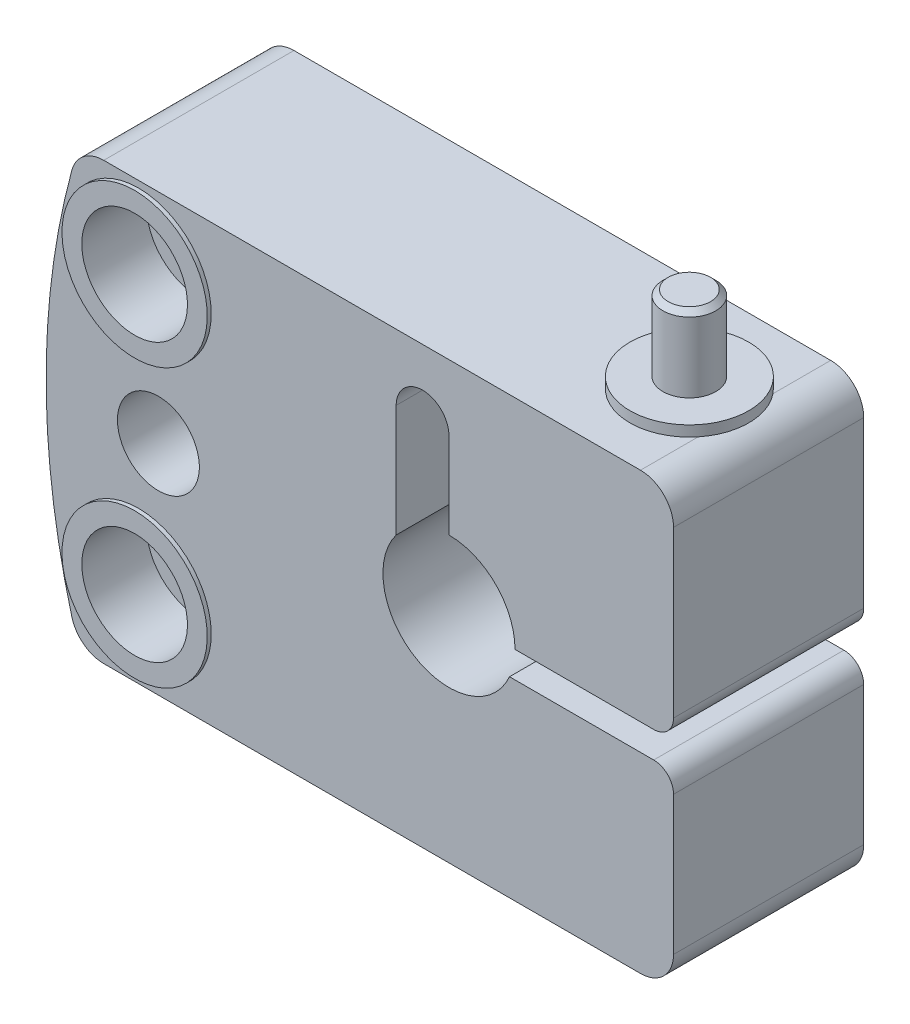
ISO-10303-21;
HEADER;
FILE_DESCRIPTION(('STEP AP214'),'2;1');
FILE_NAME('part.step','',(''),(''),'','','');
FILE_SCHEMA(('AUTOMOTIVE_DESIGN { 1 0 10303 214 1 1 1 1 }'));
ENDSEC;
DATA;
#1=APPLICATION_CONTEXT('core data for automotive mechanical design processes');
#2=APPLICATION_PROTOCOL_DEFINITION('international standard','automotive_design',2000,#1);
#3=PRODUCT_CONTEXT('',#1,'mechanical');
#4=PRODUCT('Part','Part','',(#3));
#5=PRODUCT_RELATED_PRODUCT_CATEGORY('part','',(#4));
#6=PRODUCT_DEFINITION_FORMATION('','',#4);
#7=PRODUCT_DEFINITION_CONTEXT('part definition',#1,'design');
#8=PRODUCT_DEFINITION('design','',#6,#7);
#9=PRODUCT_DEFINITION_SHAPE('','',#8);
#10=(LENGTH_UNIT() NAMED_UNIT(*) SI_UNIT(.MILLI.,.METRE.));
#11=(NAMED_UNIT(*) PLANE_ANGLE_UNIT() SI_UNIT($,.RADIAN.));
#12=(NAMED_UNIT(*) SI_UNIT($,.STERADIAN.) SOLID_ANGLE_UNIT());
#13=UNCERTAINTY_MEASURE_WITH_UNIT(LENGTH_MEASURE(1.E-05),#10,'distance_accuracy_value','');
#14=(GEOMETRIC_REPRESENTATION_CONTEXT(3) GLOBAL_UNCERTAINTY_ASSIGNED_CONTEXT((#13)) GLOBAL_UNIT_ASSIGNED_CONTEXT((#10,
#11,#12)) REPRESENTATION_CONTEXT('',''));
#15=CARTESIAN_POINT('',(0.,0.,0.));
#16=DIRECTION('',(0.,0.,1.));
#17=DIRECTION('',(1.,0.,0.));
#18=AXIS2_PLACEMENT_3D('',#15,#16,#17);
#19=CARTESIAN_POINT('',(14.5,16.5,15.));
#20=DIRECTION('',(0.,-1.,0.));
#21=DIRECTION('',(0.,0.,1.));
#22=AXIS2_PLACEMENT_3D('',#19,#20,#21);
#23=PLANE('',#22);
#24=CARTESIAN_POINT('',(11.,16.5,7.5));
#25=DIRECTION('',(0.,1.,0.));
#26=DIRECTION('',(0.,0.,-1.));
#27=AXIS2_PLACEMENT_3D('',#24,#25,#26);
#28=CIRCLE('',#27,4.5);
#29=CARTESIAN_POINT('',(14.5,16.5,4.67157287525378));
#30=VERTEX_POINT('',#29);
#31=CARTESIAN_POINT('',(14.5,16.5,10.3284271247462));
#32=VERTEX_POINT('',#31);
#33=EDGE_CURVE('E34',#30,#32,#28,.T.);
#34=ORIENTED_EDGE('',*,*,#33,.F.);
#35=DIRECTION('',(0.,0.,-1.));
#36=VECTOR('',#35,1.);
#37=CARTESIAN_POINT('',(14.5,16.5,15.));
#38=LINE('',#37,#36);
#39=CARTESIAN_POINT('',(14.5,16.5,0.3));
#40=VERTEX_POINT('',#39);
#41=EDGE_CURVE('E156',#30,#40,#38,.T.);
#42=ORIENTED_EDGE('',*,*,#41,.T.);
#43=DIRECTION('',(1.,0.,0.));
#44=VECTOR('',#43,1.);
#45=CARTESIAN_POINT('',(-26.1357434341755,16.5,0.3));
#46=LINE('',#45,#44);
#47=CARTESIAN_POINT('',(-26.1357434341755,16.5,0.3));
#48=VERTEX_POINT('',#47);
#49=EDGE_CURVE('E308',#48,#40,#46,.T.);
#50=ORIENTED_EDGE('',*,*,#49,.F.);
#51=DIRECTION('',(0.,0.,-1.));
#52=VECTOR('',#51,1.);
#53=CARTESIAN_POINT('',(-26.1357434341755,16.5,15.));
#54=LINE('',#53,#52);
#55=CARTESIAN_POINT('',(-26.1357434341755,16.5,14.7));
#56=VERTEX_POINT('',#55);
#57=EDGE_CURVE('E347',#56,#48,#54,.T.);
#58=ORIENTED_EDGE('',*,*,#57,.F.);
#59=DIRECTION('',(-1.,0.,0.));
#60=VECTOR('',#59,1.);
#61=CARTESIAN_POINT('',(14.5,16.5,14.7));
#62=LINE('',#61,#60);
#63=CARTESIAN_POINT('',(14.5,16.5,14.7));
#64=VERTEX_POINT('',#63);
#65=EDGE_CURVE('E152',#64,#56,#62,.T.);
#66=ORIENTED_EDGE('',*,*,#65,.F.);
#67=EDGE_CURVE('E149',#64,#32,#38,.T.);
#68=ORIENTED_EDGE('',*,*,#67,.T.);
#69=EDGE_LOOP('',(#34,#42,#50,#58,#66,#68));
#70=FACE_BOUND('',#69,.T.);
#71=ADVANCED_FACE('F18',(#70),#23,.F.);
#72=CARTESIAN_POINT('',(-23.5,10.5,15.));
#73=DIRECTION('',(0.,0.,-1.));
#74=DIRECTION('',(0.,-1.,0.));
#75=AXIS2_PLACEMENT_3D('',#72,#73,#74);
#76=CYLINDRICAL_SURFACE('',#75,2.25);
#77=CARTESIAN_POINT('',(-23.5,10.5,4.9));
#78=DIRECTION('',(0.,0.,-1.));
#79=DIRECTION('',(0.,-1.,0.));
#80=AXIS2_PLACEMENT_3D('',#77,#78,#79);
#81=CIRCLE('',#80,2.25);
#82=CARTESIAN_POINT('',(-23.5,8.25,4.9));
#83=VERTEX_POINT('',#82);
#84=EDGE_CURVE('E207',#83,#83,#81,.T.);
#85=ORIENTED_EDGE('',*,*,#84,.T.);
#86=EDGE_LOOP('',(#85));
#87=FACE_BOUND('',#86,.T.);
#88=CARTESIAN_POINT('',(-23.5,10.5,10.1));
#89=DIRECTION('',(0.,0.,1.));
#90=DIRECTION('',(0.,1.,0.));
#91=AXIS2_PLACEMENT_3D('',#88,#89,#90);
#92=CIRCLE('',#91,2.25);
#93=CARTESIAN_POINT('',(-23.5,12.75,10.1));
#94=VERTEX_POINT('',#93);
#95=EDGE_CURVE('E187',#94,#94,#92,.T.);
#96=ORIENTED_EDGE('',*,*,#95,.T.);
#97=EDGE_LOOP('',(#96));
#98=FACE_BOUND('',#97,.T.);
#99=ADVANCED_FACE('F389',(#87,#98),#76,.F.);
#100=CARTESIAN_POINT('',(-23.5,-10.5,15.));
#101=DIRECTION('',(0.,0.,-1.));
#102=DIRECTION('',(0.,-1.,0.));
#103=AXIS2_PLACEMENT_3D('',#100,#101,#102);
#104=CYLINDRICAL_SURFACE('',#103,2.25);
#105=CARTESIAN_POINT('',(-23.5,-10.5,4.9));
#106=DIRECTION('',(0.,0.,-1.));
#107=DIRECTION('',(0.,-1.,0.));
#108=AXIS2_PLACEMENT_3D('',#105,#106,#107);
#109=CIRCLE('',#108,2.25);
#110=CARTESIAN_POINT('',(-23.5,-12.75,4.9));
#111=VERTEX_POINT('',#110);
#112=EDGE_CURVE('E200',#111,#111,#109,.T.);
#113=ORIENTED_EDGE('',*,*,#112,.T.);
#114=EDGE_LOOP('',(#113));
#115=FACE_BOUND('',#114,.T.);
#116=CARTESIAN_POINT('',(-23.5,-10.5,10.1));
#117=DIRECTION('',(0.,0.,1.));
#118=DIRECTION('',(0.,1.,0.));
#119=AXIS2_PLACEMENT_3D('',#116,#117,#118);
#120=CIRCLE('',#119,2.25);
#121=CARTESIAN_POINT('',(-23.5,-8.25,10.1));
#122=VERTEX_POINT('',#121);
#123=EDGE_CURVE('E193',#122,#122,#120,.T.);
#124=ORIENTED_EDGE('',*,*,#123,.T.);
#125=EDGE_LOOP('',(#124));
#126=FACE_BOUND('',#125,.T.);
#127=ADVANCED_FACE('F395',(#115,#126),#104,.F.);
#128=CARTESIAN_POINT('',(0.,0.,15.));
#129=DIRECTION('',(0.,0.,1.));
#130=DIRECTION('',(0.,1.,0.));
#131=AXIS2_PLACEMENT_3D('',#128,#129,#130);
#132=PLANE('',#131);
#133=CARTESIAN_POINT('',(-23.5,10.5,15.));
#134=DIRECTION('',(0.,0.,1.));
#135=DIRECTION('',(0.,1.,0.));
#136=AXIS2_PLACEMENT_3D('',#133,#134,#135);
#137=CIRCLE('',#136,4.);
#138=CARTESIAN_POINT('',(-23.5,14.5,15.));
#139=VERTEX_POINT('',#138);
#140=EDGE_CURVE('E183',#139,#139,#137,.T.);
#141=ORIENTED_EDGE('',*,*,#140,.F.);
#142=EDGE_LOOP('',(#141));
#143=FACE_BOUND('',#142,.T.);
#144=CARTESIAN_POINT('',(-23.5,10.5,15.));
#145=DIRECTION('',(0.,0.,1.));
#146=DIRECTION('',(0.,1.,0.));
#147=AXIS2_PLACEMENT_3D('',#144,#145,#146);
#148=CIRCLE('',#147,5.5);
#149=CARTESIAN_POINT('',(-23.5,16.,15.));
#150=VERTEX_POINT('',#149);
#151=EDGE_CURVE('E211',#150,#150,#148,.T.);
#152=ORIENTED_EDGE('',*,*,#151,.T.);
#153=EDGE_LOOP('',(#152));
#154=FACE_BOUND('',#153,.T.);
#155=ADVANCED_FACE('F828',(#143,#154),#132,.T.);
#156=CARTESIAN_POINT('',(-23.5,-10.5,15.));
#157=DIRECTION('',(0.,0.,1.));
#158=DIRECTION('',(0.,1.,0.));
#159=AXIS2_PLACEMENT_3D('',#156,#157,#158);
#160=CIRCLE('',#159,4.);
#161=CARTESIAN_POINT('',(-23.5,-6.5,15.));
#162=VERTEX_POINT('',#161);
#163=EDGE_CURVE('E194',#162,#162,#160,.T.);
#164=ORIENTED_EDGE('',*,*,#163,.F.);
#165=EDGE_LOOP('',(#164));
#166=FACE_BOUND('',#165,.T.);
#167=CARTESIAN_POINT('',(-23.5,-10.5,15.));
#168=DIRECTION('',(0.,0.,1.));
#169=DIRECTION('',(0.,1.,0.));
#170=AXIS2_PLACEMENT_3D('',#167,#168,#169);
#171=CIRCLE('',#170,5.5);
#172=CARTESIAN_POINT('',(-23.5,-5.,15.));
#173=VERTEX_POINT('',#172);
#174=EDGE_CURVE('E214',#173,#173,#171,.T.);
#175=ORIENTED_EDGE('',*,*,#174,.T.);
#176=EDGE_LOOP('',(#175));
#177=FACE_BOUND('',#176,.T.);
#178=ADVANCED_FACE('F836',(#166,#177),#132,.T.);
#179=CARTESIAN_POINT('',(0.,0.,0.));
#180=DIRECTION('',(0.,0.,1.));
#181=DIRECTION('',(0.,1.,0.));
#182=AXIS2_PLACEMENT_3D('',#179,#180,#181);
#183=PLANE('',#182);
#184=CARTESIAN_POINT('',(-23.5,10.5,0.));
#185=DIRECTION('',(0.,0.,-1.));
#186=DIRECTION('',(0.,-1.,0.));
#187=AXIS2_PLACEMENT_3D('',#184,#185,#186);
#188=CIRCLE('',#187,4.);
#189=CARTESIAN_POINT('',(-23.5,6.5,0.));
#190=VERTEX_POINT('',#189);
#191=EDGE_CURVE('E208',#190,#190,#188,.T.);
#192=ORIENTED_EDGE('',*,*,#191,.F.);
#193=EDGE_LOOP('',(#192));
#194=FACE_BOUND('',#193,.T.);
#195=CARTESIAN_POINT('',(-23.5,10.5,0.));
#196=DIRECTION('',(0.,0.,-1.));
#197=DIRECTION('',(0.,-1.,0.));
#198=AXIS2_PLACEMENT_3D('',#195,#196,#197);
#199=CIRCLE('',#198,5.5);
#200=CARTESIAN_POINT('',(-23.5,5.,0.));
#201=VERTEX_POINT('',#200);
#202=EDGE_CURVE('E261',#201,#201,#199,.T.);
#203=ORIENTED_EDGE('',*,*,#202,.T.);
#204=EDGE_LOOP('',(#203));
#205=FACE_BOUND('',#204,.T.);
#206=ADVANCED_FACE('F423',(#194,#205),#183,.F.);
#207=CARTESIAN_POINT('',(-23.5,-10.5,0.));
#208=DIRECTION('',(0.,0.,-1.));
#209=DIRECTION('',(0.,-1.,0.));
#210=AXIS2_PLACEMENT_3D('',#207,#208,#209);
#211=CIRCLE('',#210,4.);
#212=CARTESIAN_POINT('',(-23.5,-14.5,0.));
#213=VERTEX_POINT('',#212);
#214=EDGE_CURVE('E201',#213,#213,#211,.T.);
#215=ORIENTED_EDGE('',*,*,#214,.F.);
#216=EDGE_LOOP('',(#215));
#217=FACE_BOUND('',#216,.T.);
#218=CARTESIAN_POINT('',(-23.5,-10.5,0.));
#219=DIRECTION('',(0.,0.,-1.));
#220=DIRECTION('',(0.,-1.,0.));
#221=AXIS2_PLACEMENT_3D('',#218,#219,#220);
#222=CIRCLE('',#221,5.5);
#223=CARTESIAN_POINT('',(-23.5,-16.,0.));
#224=VERTEX_POINT('',#223);
#225=EDGE_CURVE('E222',#224,#224,#222,.T.);
#226=ORIENTED_EDGE('',*,*,#225,.T.);
#227=EDGE_LOOP('',(#226));
#228=FACE_BOUND('',#227,.T.);
#229=ADVANCED_FACE('F417',(#217,#228),#183,.F.);
#230=CARTESIAN_POINT('',(0.,0.,15.));
#231=DIRECTION('',(0.,0.,-1.));
#232=DIRECTION('',(0.,-1.,0.));
#233=AXIS2_PLACEMENT_3D('',#230,#231,#232);
#234=CYLINDRICAL_SURFACE('',#233,5.);
#235=DIRECTION('',(0.,0.,-1.));
#236=VECTOR('',#235,1.);
#237=CARTESIAN_POINT('',(5.,0.,15.));
#238=LINE('',#237,#236);
#239=CARTESIAN_POINT('',(5.,0.,14.7));
#240=VERTEX_POINT('',#239);
#241=CARTESIAN_POINT('',(5.,0.,0.3));
#242=VERTEX_POINT('',#241);
#243=EDGE_CURVE('E354',#240,#242,#238,.T.);
#244=ORIENTED_EDGE('',*,*,#243,.F.);
#245=CARTESIAN_POINT('',(0.,0.,14.7));
#246=DIRECTION('',(0.,0.,-1.));
#247=DIRECTION('',(0.,-1.,0.));
#248=AXIS2_PLACEMENT_3D('',#245,#246,#247);
#249=CIRCLE('',#248,5.);
#250=CARTESIAN_POINT('',(0.,5.,14.7));
#251=VERTEX_POINT('',#250);
#252=EDGE_CURVE('E227',#251,#240,#249,.T.);
#253=ORIENTED_EDGE('',*,*,#252,.F.);
#254=DIRECTION('',(0.,0.,-1.));
#255=VECTOR('',#254,1.);
#256=CARTESIAN_POINT('',(0.,5.,15.));
#257=LINE('',#256,#255);
#258=CARTESIAN_POINT('',(0.,5.,0.3));
#259=VERTEX_POINT('',#258);
#260=EDGE_CURVE('E323',#251,#259,#257,.T.);
#261=ORIENTED_EDGE('',*,*,#260,.T.);
#262=CARTESIAN_POINT('',(0.,0.,0.3));
#263=DIRECTION('',(0.,0.,1.));
#264=DIRECTION('',(0.,-1.,0.));
#265=AXIS2_PLACEMENT_3D('',#262,#263,#264);
#266=CIRCLE('',#265,5.);
#267=EDGE_CURVE('E267',#242,#259,#266,.T.);
#268=ORIENTED_EDGE('',*,*,#267,.F.);
#269=EDGE_LOOP('',(#244,#253,#261,#268));
#270=FACE_BOUND('',#269,.T.);
#271=ADVANCED_FACE('F414',(#270),#234,.F.);
#272=CARTESIAN_POINT('',(5.,0.,15.));
#273=DIRECTION('',(0.,1.,0.));
#274=DIRECTION('',(-1.,0.,0.));
#275=AXIS2_PLACEMENT_3D('',#272,#273,#274);
#276=PLANE('',#275);
#277=CARTESIAN_POINT('',(11.,0.,7.5));
#278=DIRECTION('',(0.,1.,0.));
#279=DIRECTION('',(-1.,0.,0.));
#280=AXIS2_PLACEMENT_3D('',#277,#278,#279);
#281=CIRCLE('',#280,2.);
#282=CARTESIAN_POINT('',(9.,0.,7.5));
#283=VERTEX_POINT('',#282);
#284=EDGE_CURVE('E180',#283,#283,#281,.T.);
#285=ORIENTED_EDGE('',*,*,#284,.T.);
#286=EDGE_LOOP('',(#285));
#287=FACE_BOUND('',#286,.T.);
#288=DIRECTION('',(0.,0.,-1.));
#289=VECTOR('',#288,1.);
#290=CARTESIAN_POINT('',(15.5,0.,15.));
#291=LINE('',#290,#289);
#292=CARTESIAN_POINT('',(15.5,0.,14.7));
#293=VERTEX_POINT('',#292);
#294=CARTESIAN_POINT('',(15.5,0.,0.3));
#295=VERTEX_POINT('',#294);
#296=EDGE_CURVE('E352',#293,#295,#291,.T.);
#297=ORIENTED_EDGE('',*,*,#296,.F.);
#298=DIRECTION('',(1.,0.,0.));
#299=VECTOR('',#298,1.);
#300=CARTESIAN_POINT('',(5.,0.,14.7));
#301=LINE('',#300,#299);
#302=EDGE_CURVE('E215',#240,#293,#301,.T.);
#303=ORIENTED_EDGE('',*,*,#302,.F.);
#304=ORIENTED_EDGE('',*,*,#243,.T.);
#305=DIRECTION('',(-1.,0.,0.));
#306=VECTOR('',#305,1.);
#307=CARTESIAN_POINT('',(15.5,0.,0.3));
#308=LINE('',#307,#306);
#309=EDGE_CURVE('E320',#295,#242,#308,.T.);
#310=ORIENTED_EDGE('',*,*,#309,.F.);
#311=EDGE_LOOP('',(#297,#303,#304,#310));
#312=FACE_BOUND('',#311,.T.);
#313=ADVANCED_FACE('F411',(#287,#312),#276,.F.);
#314=CARTESIAN_POINT('',(15.5,1.5,15.));
#315=DIRECTION('',(0.,0.,-1.));
#316=DIRECTION('',(0.,-1.,0.));
#317=AXIS2_PLACEMENT_3D('',#314,#315,#316);
#318=CYLINDRICAL_SURFACE('',#317,1.5);
#319=DIRECTION('',(0.,0.,-1.));
#320=VECTOR('',#319,1.);
#321=CARTESIAN_POINT('',(17.,1.5,15.));
#322=LINE('',#321,#320);
#323=CARTESIAN_POINT('',(17.,1.5,14.7));
#324=VERTEX_POINT('',#323);
#325=CARTESIAN_POINT('',(17.,1.5,0.3));
#326=VERTEX_POINT('',#325);
#327=EDGE_CURVE('E350',#324,#326,#322,.T.);
#328=ORIENTED_EDGE('',*,*,#327,.F.);
#329=CARTESIAN_POINT('',(15.5,1.5,14.7));
#330=DIRECTION('',(0.,0.,-1.));
#331=DIRECTION('',(0.,-1.,0.));
#332=AXIS2_PLACEMENT_3D('',#329,#330,#331);
#333=CIRCLE('',#332,1.5);
#334=EDGE_CURVE('E226',#293,#324,#333,.F.);
#335=ORIENTED_EDGE('',*,*,#334,.F.);
#336=ORIENTED_EDGE('',*,*,#296,.T.);
#337=CARTESIAN_POINT('',(15.5,1.5,0.3));
#338=DIRECTION('',(0.,0.,-1.));
#339=DIRECTION('',(0.,-1.,0.));
#340=AXIS2_PLACEMENT_3D('',#337,#338,#339);
#341=CIRCLE('',#340,1.5);
#342=EDGE_CURVE('E317',#326,#295,#341,.T.);
#343=ORIENTED_EDGE('',*,*,#342,.F.);
#344=EDGE_LOOP('',(#328,#335,#336,#343));
#345=FACE_BOUND('',#344,.T.);
#346=ADVANCED_FACE('F407',(#345),#318,.T.);
#347=CARTESIAN_POINT('',(17.,1.5,15.));
#348=DIRECTION('',(-1.,0.,0.));
#349=DIRECTION('',(0.,0.,1.));
#350=AXIS2_PLACEMENT_3D('',#347,#348,#349);
#351=PLANE('',#350);
#352=DIRECTION('',(0.,0.,-1.));
#353=VECTOR('',#352,1.);
#354=CARTESIAN_POINT('',(17.,14.,15.));
#355=LINE('',#354,#353);
#356=CARTESIAN_POINT('',(17.,14.,14.7));
#357=VERTEX_POINT('',#356);
#358=CARTESIAN_POINT('',(17.,14.,0.3));
#359=VERTEX_POINT('',#358);
#360=EDGE_CURVE('E155',#357,#359,#355,.T.);
#361=ORIENTED_EDGE('',*,*,#360,.F.);
#362=DIRECTION('',(0.,1.,0.));
#363=VECTOR('',#362,1.);
#364=CARTESIAN_POINT('',(17.,1.5,14.7));
#365=LINE('',#364,#363);
#366=EDGE_CURVE('E255',#324,#357,#365,.T.);
#367=ORIENTED_EDGE('',*,*,#366,.F.);
#368=ORIENTED_EDGE('',*,*,#327,.T.);
#369=DIRECTION('',(0.,-1.,0.));
#370=VECTOR('',#369,1.);
#371=CARTESIAN_POINT('',(17.,14.,0.3));
#372=LINE('',#371,#370);
#373=EDGE_CURVE('E314',#359,#326,#372,.T.);
#374=ORIENTED_EDGE('',*,*,#373,.F.);
#375=EDGE_LOOP('',(#361,#367,#368,#374));
#376=FACE_BOUND('',#375,.T.);
#377=ADVANCED_FACE('F404',(#376),#351,.F.);
#378=CARTESIAN_POINT('',(14.5,14.,15.));
#379=DIRECTION('',(0.,0.,-1.));
#380=DIRECTION('',(0.,-1.,0.));
#381=AXIS2_PLACEMENT_3D('',#378,#379,#380);
#382=CYLINDRICAL_SURFACE('',#381,2.5);
#383=ORIENTED_EDGE('',*,*,#67,.F.);
#384=CARTESIAN_POINT('',(14.5,14.,14.7));
#385=DIRECTION('',(0.,0.,-1.));
#386=DIRECTION('',(0.,-1.,0.));
#387=AXIS2_PLACEMENT_3D('',#384,#385,#386);
#388=CIRCLE('',#387,2.5);
#389=EDGE_CURVE('E253',#357,#64,#388,.F.);
#390=ORIENTED_EDGE('',*,*,#389,.F.);
#391=ORIENTED_EDGE('',*,*,#360,.T.);
#392=CARTESIAN_POINT('',(14.5,14.,0.3));
#393=DIRECTION('',(0.,0.,-1.));
#394=DIRECTION('',(0.,-1.,0.));
#395=AXIS2_PLACEMENT_3D('',#392,#393,#394);
#396=CIRCLE('',#395,2.5);
#397=EDGE_CURVE('E311',#40,#359,#396,.T.);
#398=ORIENTED_EDGE('',*,*,#397,.F.);
#399=ORIENTED_EDGE('',*,*,#41,.F.);
#400=DIRECTION('',(0.,0.,-1.));
#401=VECTOR('',#400,1.);
#402=CARTESIAN_POINT('',(14.5,16.5,15.));
#403=LINE('',#402,#401);
#404=EDGE_CURVE('E159',#32,#30,#403,.T.);
#405=ORIENTED_EDGE('',*,*,#404,.F.);
#406=EDGE_LOOP('',(#383,#390,#391,#398,#399,#405));
#407=FACE_BOUND('',#406,.T.);
#408=ADVANCED_FACE('F160',(#407),#382,.T.);
#409=CARTESIAN_POINT('',(-26.1357434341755,14.,15.));
#410=DIRECTION('',(0.,0.,-1.));
#411=DIRECTION('',(0.,-1.,0.));
#412=AXIS2_PLACEMENT_3D('',#409,#410,#411);
#413=CYLINDRICAL_SURFACE('',#412,2.5);
#414=DIRECTION('',(0.,0.,-1.));
#415=VECTOR('',#414,1.);
#416=CARTESIAN_POINT('',(-28.54862864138,14.6542056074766,15.));
#417=LINE('',#416,#415);
#418=CARTESIAN_POINT('',(-28.54862864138,14.6542056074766,14.7));
#419=VERTEX_POINT('',#418);
#420=CARTESIAN_POINT('',(-28.54862864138,14.6542056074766,0.3));
#421=VERTEX_POINT('',#420);
#422=EDGE_CURVE('E345',#419,#421,#417,.T.);
#423=ORIENTED_EDGE('',*,*,#422,.F.);
#424=CARTESIAN_POINT('',(-26.1357434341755,14.,14.7));
#425=DIRECTION('',(0.,0.,-1.));
#426=DIRECTION('',(0.,-1.,0.));
#427=AXIS2_PLACEMENT_3D('',#424,#425,#426);
#428=CIRCLE('',#427,2.5);
#429=EDGE_CURVE('E250',#56,#419,#428,.F.);
#430=ORIENTED_EDGE('',*,*,#429,.F.);
#431=ORIENTED_EDGE('',*,*,#57,.T.);
#432=CARTESIAN_POINT('',(-26.1357434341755,14.,0.3));
#433=DIRECTION('',(0.,0.,-1.));
#434=DIRECTION('',(0.,-1.,0.));
#435=AXIS2_PLACEMENT_3D('',#432,#433,#434);
#436=CIRCLE('',#435,2.5);
#437=EDGE_CURVE('E305',#421,#48,#436,.T.);
#438=ORIENTED_EDGE('',*,*,#437,.F.);
#439=EDGE_LOOP('',(#423,#430,#431,#438));
#440=FACE_BOUND('',#439,.T.);
#441=ADVANCED_FACE('F400',(#440),#413,.T.);
#442=CARTESIAN_POINT('',(25.5,0.,15.));
#443=DIRECTION('',(0.,0.,-1.));
#444=DIRECTION('',(0.,-1.,0.));
#445=AXIS2_PLACEMENT_3D('',#442,#443,#444);
#446=CYLINDRICAL_SURFACE('',#445,56.);
#447=DIRECTION('',(0.,0.,-1.));
#448=VECTOR('',#447,1.);
#449=CARTESIAN_POINT('',(-28.54862864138,-14.6542056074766,15.));
#450=LINE('',#449,#448);
#451=CARTESIAN_POINT('',(-28.54862864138,-14.6542056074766,14.7));
#452=VERTEX_POINT('',#451);
#453=CARTESIAN_POINT('',(-28.54862864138,-14.6542056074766,0.3));
#454=VERTEX_POINT('',#453);
#455=EDGE_CURVE('E343',#452,#454,#450,.T.);
#456=ORIENTED_EDGE('',*,*,#455,.F.);
#457=CARTESIAN_POINT('',(25.5,0.,14.7));
#458=DIRECTION('',(0.,0.,-1.));
#459=DIRECTION('',(0.,-1.,0.));
#460=AXIS2_PLACEMENT_3D('',#457,#458,#459);
#461=CIRCLE('',#460,56.);
#462=EDGE_CURVE('E248',#419,#452,#461,.F.);
#463=ORIENTED_EDGE('',*,*,#462,.F.);
#464=ORIENTED_EDGE('',*,*,#422,.T.);
#465=CARTESIAN_POINT('',(25.5,0.,0.3));
#466=DIRECTION('',(0.,0.,-1.));
#467=DIRECTION('',(0.,-1.,0.));
#468=AXIS2_PLACEMENT_3D('',#465,#466,#467);
#469=CIRCLE('',#468,56.);
#470=EDGE_CURVE('E302',#454,#421,#469,.T.);
#471=ORIENTED_EDGE('',*,*,#470,.F.);
#472=EDGE_LOOP('',(#456,#463,#464,#471));
#473=FACE_BOUND('',#472,.T.);
#474=ADVANCED_FACE('F454',(#473),#446,.T.);
#475=CARTESIAN_POINT('',(-26.1357434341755,-14.,15.));
#476=DIRECTION('',(0.,0.,-1.));
#477=DIRECTION('',(0.,-1.,0.));
#478=AXIS2_PLACEMENT_3D('',#475,#476,#477);
#479=CYLINDRICAL_SURFACE('',#478,2.5);
#480=DIRECTION('',(0.,0.,-1.));
#481=VECTOR('',#480,1.);
#482=CARTESIAN_POINT('',(-26.1357434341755,-16.5,15.));
#483=LINE('',#482,#481);
#484=CARTESIAN_POINT('',(-26.1357434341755,-16.5,14.7));
#485=VERTEX_POINT('',#484);
#486=CARTESIAN_POINT('',(-26.1357434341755,-16.5,0.3));
#487=VERTEX_POINT('',#486);
#488=EDGE_CURVE('E341',#485,#487,#483,.T.);
#489=ORIENTED_EDGE('',*,*,#488,.F.);
#490=CARTESIAN_POINT('',(-26.1357434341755,-14.,14.7));
#491=DIRECTION('',(0.,0.,-1.));
#492=DIRECTION('',(0.,-1.,0.));
#493=AXIS2_PLACEMENT_3D('',#490,#491,#492);
#494=CIRCLE('',#493,2.5);
#495=EDGE_CURVE('E246',#452,#485,#494,.F.);
#496=ORIENTED_EDGE('',*,*,#495,.F.);
#497=ORIENTED_EDGE('',*,*,#455,.T.);
#498=CARTESIAN_POINT('',(-26.1357434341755,-14.,0.3));
#499=DIRECTION('',(0.,0.,-1.));
#500=DIRECTION('',(0.,-1.,0.));
#501=AXIS2_PLACEMENT_3D('',#498,#499,#500);
#502=CIRCLE('',#501,2.5);
#503=EDGE_CURVE('E299',#487,#454,#502,.T.);
#504=ORIENTED_EDGE('',*,*,#503,.F.);
#505=EDGE_LOOP('',(#489,#496,#497,#504));
#506=FACE_BOUND('',#505,.T.);
#507=ADVANCED_FACE('F459',(#506),#479,.T.);
#508=CARTESIAN_POINT('',(-26.1357434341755,-16.5,15.));
#509=DIRECTION('',(0.,1.,0.));
#510=DIRECTION('',(0.,0.,-1.));
#511=AXIS2_PLACEMENT_3D('',#508,#509,#510);
#512=PLANE('',#511);
#513=DIRECTION('',(0.,0.,-1.));
#514=VECTOR('',#513,1.);
#515=CARTESIAN_POINT('',(14.5,-16.5,15.));
#516=LINE('',#515,#514);
#517=CARTESIAN_POINT('',(14.5,-16.5,14.7));
#518=VERTEX_POINT('',#517);
#519=CARTESIAN_POINT('',(14.5,-16.5,0.3));
#520=VERTEX_POINT('',#519);
#521=EDGE_CURVE('E339',#518,#520,#516,.T.);
#522=ORIENTED_EDGE('',*,*,#521,.F.);
#523=DIRECTION('',(1.,0.,0.));
#524=VECTOR('',#523,1.);
#525=CARTESIAN_POINT('',(-26.1357434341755,-16.5,14.7));
#526=LINE('',#525,#524);
#527=EDGE_CURVE('E244',#485,#518,#526,.T.);
#528=ORIENTED_EDGE('',*,*,#527,.F.);
#529=ORIENTED_EDGE('',*,*,#488,.T.);
#530=DIRECTION('',(-1.,0.,0.));
#531=VECTOR('',#530,1.);
#532=CARTESIAN_POINT('',(14.5,-16.5,0.3));
#533=LINE('',#532,#531);
#534=EDGE_CURVE('E296',#520,#487,#533,.T.);
#535=ORIENTED_EDGE('',*,*,#534,.F.);
#536=EDGE_LOOP('',(#522,#528,#529,#535));
#537=FACE_BOUND('',#536,.T.);
#538=ADVANCED_FACE('F464',(#537),#512,.F.);
#539=CARTESIAN_POINT('',(14.5,-14.,15.));
#540=DIRECTION('',(0.,0.,-1.));
#541=DIRECTION('',(0.,-1.,0.));
#542=AXIS2_PLACEMENT_3D('',#539,#540,#541);
#543=CYLINDRICAL_SURFACE('',#542,2.5);
#544=DIRECTION('',(0.,0.,-1.));
#545=VECTOR('',#544,1.);
#546=CARTESIAN_POINT('',(17.,-14.,15.));
#547=LINE('',#546,#545);
#548=CARTESIAN_POINT('',(17.,-14.,14.7));
#549=VERTEX_POINT('',#548);
#550=CARTESIAN_POINT('',(17.,-14.,0.3));
#551=VERTEX_POINT('',#550);
#552=EDGE_CURVE('E337',#549,#551,#547,.T.);
#553=ORIENTED_EDGE('',*,*,#552,.F.);
#554=CARTESIAN_POINT('',(14.5,-14.,14.7));
#555=DIRECTION('',(0.,0.,-1.));
#556=DIRECTION('',(0.,-1.,0.));
#557=AXIS2_PLACEMENT_3D('',#554,#555,#556);
#558=CIRCLE('',#557,2.5);
#559=EDGE_CURVE('E242',#518,#549,#558,.F.);
#560=ORIENTED_EDGE('',*,*,#559,.F.);
#561=ORIENTED_EDGE('',*,*,#521,.T.);
#562=CARTESIAN_POINT('',(14.5,-14.,0.3));
#563=DIRECTION('',(0.,0.,-1.));
#564=DIRECTION('',(0.,-1.,0.));
#565=AXIS2_PLACEMENT_3D('',#562,#563,#564);
#566=CIRCLE('',#565,2.5);
#567=EDGE_CURVE('E293',#551,#520,#566,.T.);
#568=ORIENTED_EDGE('',*,*,#567,.F.);
#569=EDGE_LOOP('',(#553,#560,#561,#568));
#570=FACE_BOUND('',#569,.T.);
#571=ADVANCED_FACE('F470',(#570),#543,.T.);
#572=CARTESIAN_POINT('',(17.,-14.,15.));
#573=DIRECTION('',(-1.,0.,0.));
#574=DIRECTION('',(0.,0.,1.));
#575=AXIS2_PLACEMENT_3D('',#572,#573,#574);
#576=PLANE('',#575);
#577=DIRECTION('',(0.,0.,-1.));
#578=VECTOR('',#577,1.);
#579=CARTESIAN_POINT('',(17.,-3.5,15.));
#580=LINE('',#579,#578);
#581=CARTESIAN_POINT('',(17.,-3.5,14.7));
#582=VERTEX_POINT('',#581);
#583=CARTESIAN_POINT('',(17.,-3.5,0.3));
#584=VERTEX_POINT('',#583);
#585=EDGE_CURVE('E335',#582,#584,#580,.T.);
#586=ORIENTED_EDGE('',*,*,#585,.F.);
#587=DIRECTION('',(0.,1.,0.));
#588=VECTOR('',#587,1.);
#589=CARTESIAN_POINT('',(17.,-14.,14.7));
#590=LINE('',#589,#588);
#591=EDGE_CURVE('E240',#549,#582,#590,.T.);
#592=ORIENTED_EDGE('',*,*,#591,.F.);
#593=ORIENTED_EDGE('',*,*,#552,.T.);
#594=DIRECTION('',(0.,-1.,0.));
#595=VECTOR('',#594,1.);
#596=CARTESIAN_POINT('',(17.,-3.5,0.3));
#597=LINE('',#596,#595);
#598=EDGE_CURVE('E290',#584,#551,#597,.T.);
#599=ORIENTED_EDGE('',*,*,#598,.F.);
#600=EDGE_LOOP('',(#586,#592,#593,#599));
#601=FACE_BOUND('',#600,.T.);
#602=ADVANCED_FACE('F474',(#601),#576,.F.);
#603=CARTESIAN_POINT('',(15.5,-3.5,15.));
#604=DIRECTION('',(0.,0.,-1.));
#605=DIRECTION('',(0.,-1.,0.));
#606=AXIS2_PLACEMENT_3D('',#603,#604,#605);
#607=CYLINDRICAL_SURFACE('',#606,1.5);
#608=DIRECTION('',(0.,0.,-1.));
#609=VECTOR('',#608,1.);
#610=CARTESIAN_POINT('',(15.5,-2.,15.));
#611=LINE('',#610,#609);
#612=CARTESIAN_POINT('',(15.5,-2.,14.7));
#613=VERTEX_POINT('',#612);
#614=CARTESIAN_POINT('',(15.5,-2.,0.3));
#615=VERTEX_POINT('',#614);
#616=EDGE_CURVE('E333',#613,#615,#611,.T.);
#617=ORIENTED_EDGE('',*,*,#616,.F.);
#618=CARTESIAN_POINT('',(15.5,-3.5,14.7));
#619=DIRECTION('',(0.,0.,-1.));
#620=DIRECTION('',(0.,-1.,0.));
#621=AXIS2_PLACEMENT_3D('',#618,#619,#620);
#622=CIRCLE('',#621,1.5);
#623=EDGE_CURVE('E238',#582,#613,#622,.F.);
#624=ORIENTED_EDGE('',*,*,#623,.F.);
#625=ORIENTED_EDGE('',*,*,#585,.T.);
#626=CARTESIAN_POINT('',(15.5,-3.5,0.3));
#627=DIRECTION('',(0.,0.,-1.));
#628=DIRECTION('',(0.,-1.,0.));
#629=AXIS2_PLACEMENT_3D('',#626,#627,#628);
#630=CIRCLE('',#629,1.5);
#631=EDGE_CURVE('E287',#615,#584,#630,.T.);
#632=ORIENTED_EDGE('',*,*,#631,.F.);
#633=EDGE_LOOP('',(#617,#624,#625,#632));
#634=FACE_BOUND('',#633,.T.);
#635=ADVANCED_FACE('F479',(#634),#607,.T.);
#636=CARTESIAN_POINT('',(15.5,-2.,15.));
#637=DIRECTION('',(0.,-1.,0.));
#638=DIRECTION('',(1.,0.,0.));
#639=AXIS2_PLACEMENT_3D('',#636,#637,#638);
#640=PLANE('',#639);
#641=CARTESIAN_POINT('',(11.,-2.00000000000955,7.5));
#642=DIRECTION('',(0.,-1.,0.));
#643=DIRECTION('',(1.,0.,0.));
#644=AXIS2_PLACEMENT_3D('',#641,#642,#643);
#645=CIRCLE('',#644,2.);
#646=CARTESIAN_POINT('',(13.,-2.00000000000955,7.5));
#647=VERTEX_POINT('',#646);
#648=EDGE_CURVE('E165',#647,#647,#645,.F.);
#649=ORIENTED_EDGE('',*,*,#648,.F.);
#650=EDGE_LOOP('',(#649));
#651=FACE_BOUND('',#650,.T.);
#652=DIRECTION('',(0.,0.,-1.));
#653=VECTOR('',#652,1.);
#654=CARTESIAN_POINT('',(4.58257569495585,-2.,15.));
#655=LINE('',#654,#653);
#656=CARTESIAN_POINT('',(4.58257569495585,-2.,14.7));
#657=VERTEX_POINT('',#656);
#658=CARTESIAN_POINT('',(4.58257569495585,-2.,0.3));
#659=VERTEX_POINT('',#658);
#660=EDGE_CURVE('E331',#657,#659,#655,.T.);
#661=ORIENTED_EDGE('',*,*,#660,.F.);
#662=DIRECTION('',(-1.,0.,0.));
#663=VECTOR('',#662,1.);
#664=CARTESIAN_POINT('',(15.5,-2.,14.7));
#665=LINE('',#664,#663);
#666=EDGE_CURVE('E236',#613,#657,#665,.T.);
#667=ORIENTED_EDGE('',*,*,#666,.F.);
#668=ORIENTED_EDGE('',*,*,#616,.T.);
#669=DIRECTION('',(1.,0.,0.));
#670=VECTOR('',#669,1.);
#671=CARTESIAN_POINT('',(4.58257569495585,-2.,0.3));
#672=LINE('',#671,#670);
#673=EDGE_CURVE('E284',#659,#615,#672,.T.);
#674=ORIENTED_EDGE('',*,*,#673,.F.);
#675=EDGE_LOOP('',(#661,#667,#668,#674));
#676=FACE_BOUND('',#675,.T.);
#677=ADVANCED_FACE('F485',(#651,#676),#640,.F.);
#678=CARTESIAN_POINT('',(0.,0.,15.));
#679=DIRECTION('',(0.,0.,-1.));
#680=DIRECTION('',(0.,-1.,0.));
#681=AXIS2_PLACEMENT_3D('',#678,#679,#680);
#682=CYLINDRICAL_SURFACE('',#681,5.);
#683=DIRECTION('',(0.,0.,-1.));
#684=VECTOR('',#683,1.);
#685=CARTESIAN_POINT('',(-4.,3.,15.));
#686=LINE('',#685,#684);
#687=CARTESIAN_POINT('',(-4.,3.,14.7));
#688=VERTEX_POINT('',#687);
#689=CARTESIAN_POINT('',(-4.,3.,0.3));
#690=VERTEX_POINT('',#689);
#691=EDGE_CURVE('E329',#688,#690,#686,.T.);
#692=ORIENTED_EDGE('',*,*,#691,.F.);
#693=CARTESIAN_POINT('',(0.,0.,14.7));
#694=DIRECTION('',(0.,0.,-1.));
#695=DIRECTION('',(0.,-1.,0.));
#696=AXIS2_PLACEMENT_3D('',#693,#694,#695);
#697=CIRCLE('',#696,5.);
#698=EDGE_CURVE('E234',#657,#688,#697,.T.);
#699=ORIENTED_EDGE('',*,*,#698,.F.);
#700=ORIENTED_EDGE('',*,*,#660,.T.);
#701=CARTESIAN_POINT('',(0.,0.,0.3));
#702=DIRECTION('',(0.,0.,1.));
#703=DIRECTION('',(0.,-1.,0.));
#704=AXIS2_PLACEMENT_3D('',#701,#702,#703);
#705=CIRCLE('',#704,5.);
#706=EDGE_CURVE('E281',#690,#659,#705,.T.);
#707=ORIENTED_EDGE('',*,*,#706,.F.);
#708=EDGE_LOOP('',(#692,#699,#700,#707));
#709=FACE_BOUND('',#708,.T.);
#710=ADVANCED_FACE('F489',(#709),#682,.F.);
#711=CARTESIAN_POINT('',(-4.,11.5,15.));
#712=DIRECTION('',(-1.,0.,0.));
#713=DIRECTION('',(0.,-1.,0.));
#714=AXIS2_PLACEMENT_3D('',#711,#712,#713);
#715=PLANE('',#714);
#716=DIRECTION('',(0.,0.,-1.));
#717=VECTOR('',#716,1.);
#718=CARTESIAN_POINT('',(-4.,11.5,15.));
#719=LINE('',#718,#717);
#720=CARTESIAN_POINT('',(-4.,11.5,14.7));
#721=VERTEX_POINT('',#720);
#722=CARTESIAN_POINT('',(-4.,11.5,0.3));
#723=VERTEX_POINT('',#722);
#724=EDGE_CURVE('E327',#721,#723,#719,.T.);
#725=ORIENTED_EDGE('',*,*,#724,.F.);
#726=DIRECTION('',(0.,1.,0.));
#727=VECTOR('',#726,1.);
#728=CARTESIAN_POINT('',(-4.,3.,14.7));
#729=LINE('',#728,#727);
#730=EDGE_CURVE('E232',#688,#721,#729,.T.);
#731=ORIENTED_EDGE('',*,*,#730,.F.);
#732=ORIENTED_EDGE('',*,*,#691,.T.);
#733=DIRECTION('',(0.,-1.,0.));
#734=VECTOR('',#733,1.);
#735=CARTESIAN_POINT('',(-4.,11.5,0.3));
#736=LINE('',#735,#734);
#737=EDGE_CURVE('E278',#723,#690,#736,.T.);
#738=ORIENTED_EDGE('',*,*,#737,.F.);
#739=EDGE_LOOP('',(#725,#731,#732,#738));
#740=FACE_BOUND('',#739,.T.);
#741=ADVANCED_FACE('F494',(#740),#715,.F.);
#742=CARTESIAN_POINT('',(-2.,11.5,15.));
#743=DIRECTION('',(0.,0.,-1.));
#744=DIRECTION('',(0.,-1.,0.));
#745=AXIS2_PLACEMENT_3D('',#742,#743,#744);
#746=CYLINDRICAL_SURFACE('',#745,2.);
#747=DIRECTION('',(0.,0.,-1.));
#748=VECTOR('',#747,1.);
#749=CARTESIAN_POINT('',(0.,11.5,15.));
#750=LINE('',#749,#748);
#751=CARTESIAN_POINT('',(0.,11.5,14.7));
#752=VERTEX_POINT('',#751);
#753=CARTESIAN_POINT('',(0.,11.5,0.3));
#754=VERTEX_POINT('',#753);
#755=EDGE_CURVE('E325',#752,#754,#750,.T.);
#756=ORIENTED_EDGE('',*,*,#755,.F.);
#757=CARTESIAN_POINT('',(-2.,11.5,14.7));
#758=DIRECTION('',(0.,0.,-1.));
#759=DIRECTION('',(0.,-1.,0.));
#760=AXIS2_PLACEMENT_3D('',#757,#758,#759);
#761=CIRCLE('',#760,2.);
#762=EDGE_CURVE('E42',#721,#752,#761,.T.);
#763=ORIENTED_EDGE('',*,*,#762,.F.);
#764=ORIENTED_EDGE('',*,*,#724,.T.);
#765=CARTESIAN_POINT('',(-2.,11.5,0.3));
#766=DIRECTION('',(0.,0.,1.));
#767=DIRECTION('',(0.,-1.,0.));
#768=AXIS2_PLACEMENT_3D('',#765,#766,#767);
#769=CIRCLE('',#768,2.);
#770=EDGE_CURVE('E275',#754,#723,#769,.T.);
#771=ORIENTED_EDGE('',*,*,#770,.F.);
#772=EDGE_LOOP('',(#756,#763,#764,#771));
#773=FACE_BOUND('',#772,.T.);
#774=ADVANCED_FACE('F498',(#773),#746,.F.);
#775=CARTESIAN_POINT('',(0.,5.,15.));
#776=DIRECTION('',(1.,0.,0.));
#777=DIRECTION('',(0.,0.,-1.));
#778=AXIS2_PLACEMENT_3D('',#775,#776,#777);
#779=PLANE('',#778);
#780=ORIENTED_EDGE('',*,*,#260,.F.);
#781=DIRECTION('',(0.,-1.,0.));
#782=VECTOR('',#781,1.);
#783=CARTESIAN_POINT('',(0.,11.5,14.7));
#784=LINE('',#783,#782);
#785=EDGE_CURVE('E229',#752,#251,#784,.T.);
#786=ORIENTED_EDGE('',*,*,#785,.F.);
#787=ORIENTED_EDGE('',*,*,#755,.T.);
#788=DIRECTION('',(0.,1.,0.));
#789=VECTOR('',#788,1.);
#790=CARTESIAN_POINT('',(0.,5.,0.3));
#791=LINE('',#790,#789);
#792=EDGE_CURVE('E272',#259,#754,#791,.T.);
#793=ORIENTED_EDGE('',*,*,#792,.F.);
#794=EDGE_LOOP('',(#780,#786,#787,#793));
#795=FACE_BOUND('',#794,.T.);
#796=ADVANCED_FACE('F500',(#795),#779,.F.);
#797=CARTESIAN_POINT('',(0.,0.,0.3));
#798=DIRECTION('',(0.,0.,-1.));
#799=DIRECTION('',(0.,-1.,0.));
#800=AXIS2_PLACEMENT_3D('',#797,#798,#799);
#801=PLANE('',#800);
#802=CARTESIAN_POINT('',(-22.,0.,0.3));
#803=DIRECTION('',(0.,0.,-1.));
#804=DIRECTION('',(-1.,0.,0.));
#805=AXIS2_PLACEMENT_3D('',#802,#803,#804);
#806=CIRCLE('',#805,3.1);
#807=CARTESIAN_POINT('',(-25.1,0.,0.3));
#808=VERTEX_POINT('',#807);
#809=EDGE_CURVE('E171',#808,#808,#806,.F.);
#810=ORIENTED_EDGE('',*,*,#809,.T.);
#811=EDGE_LOOP('',(#810));
#812=FACE_BOUND('',#811,.T.);
#813=CARTESIAN_POINT('',(-23.5,-10.5,0.3));
#814=DIRECTION('',(0.,0.,-1.));
#815=DIRECTION('',(0.,-1.,0.));
#816=AXIS2_PLACEMENT_3D('',#813,#814,#815);
#817=CIRCLE('',#816,5.5);
#818=CARTESIAN_POINT('',(-23.5,-16.,0.3));
#819=VERTEX_POINT('',#818);
#820=EDGE_CURVE('E258',#819,#819,#817,.T.);
#821=ORIENTED_EDGE('',*,*,#820,.F.);
#822=EDGE_LOOP('',(#821));
#823=FACE_BOUND('',#822,.T.);
#824=CARTESIAN_POINT('',(-23.5,10.5,0.3));
#825=DIRECTION('',(0.,0.,-1.));
#826=DIRECTION('',(0.,-1.,0.));
#827=AXIS2_PLACEMENT_3D('',#824,#825,#826);
#828=CIRCLE('',#827,5.5);
#829=CARTESIAN_POINT('',(-23.5,5.,0.3));
#830=VERTEX_POINT('',#829);
#831=EDGE_CURVE('E264',#830,#830,#828,.T.);
#832=ORIENTED_EDGE('',*,*,#831,.F.);
#833=EDGE_LOOP('',(#832));
#834=FACE_BOUND('',#833,.T.);
#835=ORIENTED_EDGE('',*,*,#267,.T.);
#836=ORIENTED_EDGE('',*,*,#792,.T.);
#837=ORIENTED_EDGE('',*,*,#770,.T.);
#838=ORIENTED_EDGE('',*,*,#737,.T.);
#839=ORIENTED_EDGE('',*,*,#706,.T.);
#840=ORIENTED_EDGE('',*,*,#673,.T.);
#841=ORIENTED_EDGE('',*,*,#631,.T.);
#842=ORIENTED_EDGE('',*,*,#598,.T.);
#843=ORIENTED_EDGE('',*,*,#567,.T.);
#844=ORIENTED_EDGE('',*,*,#534,.T.);
#845=ORIENTED_EDGE('',*,*,#503,.T.);
#846=ORIENTED_EDGE('',*,*,#470,.T.);
#847=ORIENTED_EDGE('',*,*,#437,.T.);
#848=ORIENTED_EDGE('',*,*,#49,.T.);
#849=ORIENTED_EDGE('',*,*,#397,.T.);
#850=ORIENTED_EDGE('',*,*,#373,.T.);
#851=ORIENTED_EDGE('',*,*,#342,.T.);
#852=ORIENTED_EDGE('',*,*,#309,.T.);
#853=EDGE_LOOP('',(#835,#836,#837,#838,#839,#840,#841,#842,#843,#844,#845,#846,#847,#848,#849,
#850,#851,#852));
#854=FACE_BOUND('',#853,.T.);
#855=ADVANCED_FACE('F435',(#812,#823,#834,#854),#801,.T.);
#856=CARTESIAN_POINT('',(-23.5,10.5,0.3));
#857=DIRECTION('',(0.,0.,-1.));
#858=DIRECTION('',(0.,-1.,0.));
#859=AXIS2_PLACEMENT_3D('',#856,#857,#858);
#860=CYLINDRICAL_SURFACE('',#859,5.5);
#861=ORIENTED_EDGE('',*,*,#831,.T.);
#862=EDGE_LOOP('',(#861));
#863=FACE_BOUND('',#862,.T.);
#864=ORIENTED_EDGE('',*,*,#202,.F.);
#865=EDGE_LOOP('',(#864));
#866=FACE_BOUND('',#865,.T.);
#867=ADVANCED_FACE('F508',(#863,#866),#860,.T.);
#868=CARTESIAN_POINT('',(-23.5,-10.5,0.3));
#869=DIRECTION('',(0.,0.,-1.));
#870=DIRECTION('',(0.,-1.,0.));
#871=AXIS2_PLACEMENT_3D('',#868,#869,#870);
#872=CYLINDRICAL_SURFACE('',#871,5.5);
#873=ORIENTED_EDGE('',*,*,#820,.T.);
#874=EDGE_LOOP('',(#873));
#875=FACE_BOUND('',#874,.T.);
#876=ORIENTED_EDGE('',*,*,#225,.F.);
#877=EDGE_LOOP('',(#876));
#878=FACE_BOUND('',#877,.T.);
#879=ADVANCED_FACE('F656',(#875,#878),#872,.T.);
#880=CARTESIAN_POINT('',(-23.5,10.5,-57.538136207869));
#881=DIRECTION('',(0.,0.,1.));
#882=DIRECTION('',(0.,1.,0.));
#883=AXIS2_PLACEMENT_3D('',#880,#881,#882);
#884=CYLINDRICAL_SURFACE('',#883,5.5);
#885=ORIENTED_EDGE('',*,*,#151,.F.);
#886=EDGE_LOOP('',(#885));
#887=FACE_BOUND('',#886,.T.);
#888=CARTESIAN_POINT('',(-23.5,10.5,14.7));
#889=DIRECTION('',(0.,0.,-1.));
#890=DIRECTION('',(0.,-1.,0.));
#891=AXIS2_PLACEMENT_3D('',#888,#889,#890);
#892=CIRCLE('',#891,5.5);
#893=CARTESIAN_POINT('',(-23.5,5.,14.7));
#894=VERTEX_POINT('',#893);
#895=EDGE_CURVE('E219',#894,#894,#892,.F.);
#896=ORIENTED_EDGE('',*,*,#895,.T.);
#897=EDGE_LOOP('',(#896));
#898=FACE_BOUND('',#897,.T.);
#899=ADVANCED_FACE('F664',(#887,#898),#884,.T.);
#900=CARTESIAN_POINT('',(-23.5,-10.5,-57.538136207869));
#901=DIRECTION('',(0.,0.,1.));
#902=DIRECTION('',(0.,1.,0.));
#903=AXIS2_PLACEMENT_3D('',#900,#901,#902);
#904=CYLINDRICAL_SURFACE('',#903,5.5);
#905=ORIENTED_EDGE('',*,*,#174,.F.);
#906=EDGE_LOOP('',(#905));
#907=FACE_BOUND('',#906,.T.);
#908=CARTESIAN_POINT('',(-23.5,-10.5,14.7));
#909=DIRECTION('',(0.,0.,-1.));
#910=DIRECTION('',(0.,-1.,0.));
#911=AXIS2_PLACEMENT_3D('',#908,#909,#910);
#912=CIRCLE('',#911,5.5);
#913=CARTESIAN_POINT('',(-23.5,-16.,14.7));
#914=VERTEX_POINT('',#913);
#915=EDGE_CURVE('E218',#914,#914,#912,.F.);
#916=ORIENTED_EDGE('',*,*,#915,.T.);
#917=EDGE_LOOP('',(#916));
#918=FACE_BOUND('',#917,.T.);
#919=ADVANCED_FACE('F673',(#907,#918),#904,.T.);
#920=CARTESIAN_POINT('',(0.,0.,14.7));
#921=DIRECTION('',(0.,0.,-1.));
#922=DIRECTION('',(0.,-1.,0.));
#923=AXIS2_PLACEMENT_3D('',#920,#921,#922);
#924=PLANE('',#923);
#925=CARTESIAN_POINT('',(-22.,0.,14.7));
#926=DIRECTION('',(0.,0.,-1.));
#927=DIRECTION('',(-1.,0.,0.));
#928=AXIS2_PLACEMENT_3D('',#925,#926,#927);
#929=CIRCLE('',#928,3.1);
#930=CARTESIAN_POINT('',(-25.1,0.,14.7));
#931=VERTEX_POINT('',#930);
#932=EDGE_CURVE('E22',#931,#931,#929,.F.);
#933=ORIENTED_EDGE('',*,*,#932,.F.);
#934=EDGE_LOOP('',(#933));
#935=FACE_BOUND('',#934,.T.);
#936=ORIENTED_EDGE('',*,*,#252,.T.);
#937=ORIENTED_EDGE('',*,*,#302,.T.);
#938=ORIENTED_EDGE('',*,*,#334,.T.);
#939=ORIENTED_EDGE('',*,*,#366,.T.);
#940=ORIENTED_EDGE('',*,*,#389,.T.);
#941=ORIENTED_EDGE('',*,*,#65,.T.);
#942=ORIENTED_EDGE('',*,*,#429,.T.);
#943=ORIENTED_EDGE('',*,*,#462,.T.);
#944=ORIENTED_EDGE('',*,*,#495,.T.);
#945=ORIENTED_EDGE('',*,*,#527,.T.);
#946=ORIENTED_EDGE('',*,*,#559,.T.);
#947=ORIENTED_EDGE('',*,*,#591,.T.);
#948=ORIENTED_EDGE('',*,*,#623,.T.);
#949=ORIENTED_EDGE('',*,*,#666,.T.);
#950=ORIENTED_EDGE('',*,*,#698,.T.);
#951=ORIENTED_EDGE('',*,*,#730,.T.);
#952=ORIENTED_EDGE('',*,*,#762,.T.);
#953=ORIENTED_EDGE('',*,*,#785,.T.);
#954=EDGE_LOOP('',(#936,#937,#938,#939,#940,#941,#942,#943,#944,#945,#946,#947,#948,#949,#950,
#951,#952,#953));
#955=FACE_BOUND('',#954,.T.);
#956=ORIENTED_EDGE('',*,*,#915,.F.);
#957=EDGE_LOOP('',(#956));
#958=FACE_BOUND('',#957,.T.);
#959=ORIENTED_EDGE('',*,*,#895,.F.);
#960=EDGE_LOOP('',(#959));
#961=FACE_BOUND('',#960,.T.);
#962=ADVANCED_FACE('F442',(#935,#955,#958,#961),#924,.F.);
#963=CARTESIAN_POINT('',(-23.5,10.5,4.9));
#964=DIRECTION('',(0.,0.,-1.));
#965=DIRECTION('',(0.,-1.,0.));
#966=AXIS2_PLACEMENT_3D('',#963,#964,#965);
#967=CYLINDRICAL_SURFACE('',#966,4.);
#968=CARTESIAN_POINT('',(-23.5,10.5,4.9));
#969=DIRECTION('',(0.,0.,-1.));
#970=DIRECTION('',(0.,-1.,0.));
#971=AXIS2_PLACEMENT_3D('',#968,#969,#970);
#972=CIRCLE('',#971,4.);
#973=CARTESIAN_POINT('',(-23.5,6.5,4.9));
#974=VERTEX_POINT('',#973);
#975=EDGE_CURVE('E204',#974,#974,#972,.T.);
#976=ORIENTED_EDGE('',*,*,#975,.F.);
#977=EDGE_LOOP('',(#976));
#978=FACE_BOUND('',#977,.T.);
#979=ORIENTED_EDGE('',*,*,#191,.T.);
#980=EDGE_LOOP('',(#979));
#981=FACE_BOUND('',#980,.T.);
#982=ADVANCED_FACE('F691',(#978,#981),#967,.F.);
#983=CARTESIAN_POINT('',(-23.5,10.5,4.9));
#984=DIRECTION('',(0.,0.,-1.));
#985=DIRECTION('',(0.,-1.,0.));
#986=AXIS2_PLACEMENT_3D('',#983,#984,#985);
#987=PLANE('',#986);
#988=ORIENTED_EDGE('',*,*,#84,.F.);
#989=EDGE_LOOP('',(#988));
#990=FACE_BOUND('',#989,.T.);
#991=ORIENTED_EDGE('',*,*,#975,.T.);
#992=EDGE_LOOP('',(#991));
#993=FACE_BOUND('',#992,.T.);
#994=ADVANCED_FACE('F700',(#990,#993),#987,.T.);
#995=CARTESIAN_POINT('',(-23.5,-10.5,4.9));
#996=DIRECTION('',(0.,0.,-1.));
#997=DIRECTION('',(0.,-1.,0.));
#998=AXIS2_PLACEMENT_3D('',#995,#996,#997);
#999=CYLINDRICAL_SURFACE('',#998,4.);
#1000=CARTESIAN_POINT('',(-23.5,-10.5,4.9));
#1001=DIRECTION('',(0.,0.,-1.));
#1002=DIRECTION('',(0.,-1.,0.));
#1003=AXIS2_PLACEMENT_3D('',#1000,#1001,#1002);
#1004=CIRCLE('',#1003,4.);
#1005=CARTESIAN_POINT('',(-23.5,-14.5,4.9));
#1006=VERTEX_POINT('',#1005);
#1007=EDGE_CURVE('E197',#1006,#1006,#1004,.T.);
#1008=ORIENTED_EDGE('',*,*,#1007,.F.);
#1009=EDGE_LOOP('',(#1008));
#1010=FACE_BOUND('',#1009,.T.);
#1011=ORIENTED_EDGE('',*,*,#214,.T.);
#1012=EDGE_LOOP('',(#1011));
#1013=FACE_BOUND('',#1012,.T.);
#1014=ADVANCED_FACE('F709',(#1010,#1013),#999,.F.);
#1015=CARTESIAN_POINT('',(-23.5,-10.5,4.9));
#1016=DIRECTION('',(0.,0.,-1.));
#1017=DIRECTION('',(0.,-1.,0.));
#1018=AXIS2_PLACEMENT_3D('',#1015,#1016,#1017);
#1019=PLANE('',#1018);
#1020=ORIENTED_EDGE('',*,*,#112,.F.);
#1021=EDGE_LOOP('',(#1020));
#1022=FACE_BOUND('',#1021,.T.);
#1023=ORIENTED_EDGE('',*,*,#1007,.T.);
#1024=EDGE_LOOP('',(#1023));
#1025=FACE_BOUND('',#1024,.T.);
#1026=ADVANCED_FACE('F718',(#1022,#1025),#1019,.T.);
#1027=CARTESIAN_POINT('',(-23.5,-10.5,10.1));
#1028=DIRECTION('',(0.,0.,1.));
#1029=DIRECTION('',(0.,1.,0.));
#1030=AXIS2_PLACEMENT_3D('',#1027,#1028,#1029);
#1031=CYLINDRICAL_SURFACE('',#1030,4.);
#1032=CARTESIAN_POINT('',(-23.5,-10.5,10.1));
#1033=DIRECTION('',(0.,0.,1.));
#1034=DIRECTION('',(0.,1.,0.));
#1035=AXIS2_PLACEMENT_3D('',#1032,#1033,#1034);
#1036=CIRCLE('',#1035,4.);
#1037=CARTESIAN_POINT('',(-23.5,-6.5,10.1));
#1038=VERTEX_POINT('',#1037);
#1039=EDGE_CURVE('E190',#1038,#1038,#1036,.T.);
#1040=ORIENTED_EDGE('',*,*,#1039,.F.);
#1041=EDGE_LOOP('',(#1040));
#1042=FACE_BOUND('',#1041,.T.);
#1043=ORIENTED_EDGE('',*,*,#163,.T.);
#1044=EDGE_LOOP('',(#1043));
#1045=FACE_BOUND('',#1044,.T.);
#1046=ADVANCED_FACE('F727',(#1042,#1045),#1031,.F.);
#1047=CARTESIAN_POINT('',(-23.5,-10.5,10.1));
#1048=DIRECTION('',(0.,0.,1.));
#1049=DIRECTION('',(0.,1.,0.));
#1050=AXIS2_PLACEMENT_3D('',#1047,#1048,#1049);
#1051=PLANE('',#1050);
#1052=ORIENTED_EDGE('',*,*,#123,.F.);
#1053=EDGE_LOOP('',(#1052));
#1054=FACE_BOUND('',#1053,.T.);
#1055=ORIENTED_EDGE('',*,*,#1039,.T.);
#1056=EDGE_LOOP('',(#1055));
#1057=FACE_BOUND('',#1056,.T.);
#1058=ADVANCED_FACE('F736',(#1054,#1057),#1051,.T.);
#1059=CARTESIAN_POINT('',(-23.5,10.5,10.1));
#1060=DIRECTION('',(0.,0.,1.));
#1061=DIRECTION('',(0.,1.,0.));
#1062=AXIS2_PLACEMENT_3D('',#1059,#1060,#1061);
#1063=CYLINDRICAL_SURFACE('',#1062,4.);
#1064=CARTESIAN_POINT('',(-23.5,10.5,10.1));
#1065=DIRECTION('',(0.,0.,1.));
#1066=DIRECTION('',(0.,1.,0.));
#1067=AXIS2_PLACEMENT_3D('',#1064,#1065,#1066);
#1068=CIRCLE('',#1067,4.);
#1069=CARTESIAN_POINT('',(-23.5,14.5,10.1));
#1070=VERTEX_POINT('',#1069);
#1071=EDGE_CURVE('E184',#1070,#1070,#1068,.T.);
#1072=ORIENTED_EDGE('',*,*,#1071,.F.);
#1073=EDGE_LOOP('',(#1072));
#1074=FACE_BOUND('',#1073,.T.);
#1075=ORIENTED_EDGE('',*,*,#140,.T.);
#1076=EDGE_LOOP('',(#1075));
#1077=FACE_BOUND('',#1076,.T.);
#1078=ADVANCED_FACE('F745',(#1074,#1077),#1063,.F.);
#1079=CARTESIAN_POINT('',(-23.5,10.5,10.1));
#1080=DIRECTION('',(0.,0.,1.));
#1081=DIRECTION('',(0.,1.,0.));
#1082=AXIS2_PLACEMENT_3D('',#1079,#1080,#1081);
#1083=PLANE('',#1082);
#1084=ORIENTED_EDGE('',*,*,#95,.F.);
#1085=EDGE_LOOP('',(#1084));
#1086=FACE_BOUND('',#1085,.T.);
#1087=ORIENTED_EDGE('',*,*,#1071,.T.);
#1088=EDGE_LOOP('',(#1087));
#1089=FACE_BOUND('',#1088,.T.);
#1090=ADVANCED_FACE('F754',(#1086,#1089),#1083,.T.);
#1091=CARTESIAN_POINT('',(11.,-500000.,7.5));
#1092=DIRECTION('',(0.,1.,0.));
#1093=DIRECTION('',(0.,0.,-1.));
#1094=AXIS2_PLACEMENT_3D('',#1091,#1092,#1093);
#1095=CYLINDRICAL_SURFACE('',#1094,2.);
#1096=ORIENTED_EDGE('',*,*,#648,.T.);
#1097=EDGE_LOOP('',(#1096));
#1098=FACE_BOUND('',#1097,.T.);
#1099=ORIENTED_EDGE('',*,*,#284,.F.);
#1100=EDGE_LOOP('',(#1099));
#1101=FACE_BOUND('',#1100,.T.);
#1102=ADVANCED_FACE('F386',(#1098,#1101),#1095,.T.);
#1103=CARTESIAN_POINT('',(11.,16.5,7.5));
#1104=DIRECTION('',(0.,1.,0.));
#1105=DIRECTION('',(0.,0.,-1.));
#1106=AXIS2_PLACEMENT_3D('',#1103,#1104,#1105);
#1107=PLANE('',#1106);
#1108=EDGE_CURVE('E170',#32,#30,#28,.T.);
#1109=ORIENTED_EDGE('',*,*,#1108,.F.);
#1110=ORIENTED_EDGE('',*,*,#404,.T.);
#1111=EDGE_LOOP('',(#1109,#1110));
#1112=FACE_BOUND('',#1111,.T.);
#1113=ADVANCED_FACE('F173',(#1112),#1107,.F.);
#1114=CARTESIAN_POINT('',(11.,17.3,7.5));
#1115=DIRECTION('',(0.,-1.,0.));
#1116=DIRECTION('',(0.,0.,1.));
#1117=AXIS2_PLACEMENT_3D('',#1114,#1115,#1116);
#1118=CYLINDRICAL_SURFACE('',#1117,4.5);
#1119=CARTESIAN_POINT('',(11.,17.3,7.5));
#1120=DIRECTION('',(0.,1.,0.));
#1121=DIRECTION('',(0.,0.,-1.));
#1122=AXIS2_PLACEMENT_3D('',#1119,#1120,#1121);
#1123=CIRCLE('',#1122,4.5);
#1124=CARTESIAN_POINT('',(11.,17.3,3.));
#1125=VERTEX_POINT('',#1124);
#1126=EDGE_CURVE('E166',#1125,#1125,#1123,.T.);
#1127=ORIENTED_EDGE('',*,*,#1126,.F.);
#1128=EDGE_LOOP('',(#1127));
#1129=FACE_BOUND('',#1128,.T.);
#1130=ORIENTED_EDGE('',*,*,#1108,.T.);
#1131=ORIENTED_EDGE('',*,*,#33,.T.);
#1132=EDGE_LOOP('',(#1130,#1131));
#1133=FACE_BOUND('',#1132,.T.);
#1134=ADVANCED_FACE('F169',(#1129,#1133),#1118,.T.);
#1135=CARTESIAN_POINT('',(11.,17.3,7.5));
#1136=DIRECTION('',(0.,1.,0.));
#1137=DIRECTION('',(0.,0.,-1.));
#1138=AXIS2_PLACEMENT_3D('',#1135,#1136,#1137);
#1139=PLANE('',#1138);
#1140=CARTESIAN_POINT('',(11.,17.2999999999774,7.5));
#1141=DIRECTION('',(0.,1.,0.));
#1142=DIRECTION('',(0.,0.,-1.));
#1143=AXIS2_PLACEMENT_3D('',#1140,#1141,#1142);
#1144=CIRCLE('',#1143,2.);
#1145=CARTESIAN_POINT('',(11.,17.2999999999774,5.5));
#1146=VERTEX_POINT('',#1145);
#1147=EDGE_CURVE('E356',#1146,#1146,#1144,.F.);
#1148=ORIENTED_EDGE('',*,*,#1147,.T.);
#1149=EDGE_LOOP('',(#1148));
#1150=FACE_BOUND('',#1149,.T.);
#1151=ORIENTED_EDGE('',*,*,#1126,.T.);
#1152=EDGE_LOOP('',(#1151));
#1153=FACE_BOUND('',#1152,.T.);
#1154=ADVANCED_FACE('F785',(#1150,#1153),#1139,.T.);
#1155=CARTESIAN_POINT('',(11.,23.,7.5));
#1156=DIRECTION('',(0.,1.,0.));
#1157=DIRECTION('',(0.,0.,-1.));
#1158=AXIS2_PLACEMENT_3D('',#1155,#1156,#1157);
#1159=PLANE('',#1158);
#1160=CARTESIAN_POINT('',(11.,23.,7.5));
#1161=DIRECTION('',(0.,1.,0.));
#1162=DIRECTION('',(0.,0.,-1.));
#1163=AXIS2_PLACEMENT_3D('',#1160,#1161,#1162);
#1164=CIRCLE('',#1163,1.59999999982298);
#1165=CARTESIAN_POINT('',(11.,23.,5.90000000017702));
#1166=VERTEX_POINT('',#1165);
#1167=EDGE_CURVE('E27',#1166,#1166,#1164,.T.);
#1168=ORIENTED_EDGE('',*,*,#1167,.T.);
#1169=EDGE_LOOP('',(#1168));
#1170=FACE_BOUND('',#1169,.T.);
#1171=ADVANCED_FACE('F370',(#1170),#1159,.T.);
#1172=CARTESIAN_POINT('',(11.,22.5999999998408,7.5));
#1173=DIRECTION('',(0.,1.,0.));
#1174=DIRECTION('',(0.,0.,-1.));
#1175=AXIS2_PLACEMENT_3D('',#1172,#1173,#1174);
#1176=CIRCLE('',#1175,2.);
#1177=CARTESIAN_POINT('',(11.,22.5999999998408,5.5));
#1178=VERTEX_POINT('',#1177);
#1179=EDGE_CURVE('E12',#1178,#1178,#1176,.F.);
#1180=ORIENTED_EDGE('',*,*,#1179,.T.);
#1181=EDGE_LOOP('',(#1180));
#1182=FACE_BOUND('',#1181,.T.);
#1183=ORIENTED_EDGE('',*,*,#1147,.F.);
#1184=EDGE_LOOP('',(#1183));
#1185=FACE_BOUND('',#1184,.T.);
#1186=ADVANCED_FACE('F374',(#1182,#1185),#1095,.T.);
#1187=CARTESIAN_POINT('',(11.,23.0000000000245,7.5));
#1188=DIRECTION('',(0.,-1.,0.));
#1189=DIRECTION('',(0.,0.,1.));
#1190=AXIS2_PLACEMENT_3D('',#1187,#1188,#1189);
#1191=CONICAL_SURFACE('',#1190,1.59999999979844,0.785398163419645);
#1192=ORIENTED_EDGE('',*,*,#1179,.F.);
#1193=EDGE_LOOP('',(#1192));
#1194=FACE_BOUND('',#1193,.T.);
#1195=ORIENTED_EDGE('',*,*,#1167,.F.);
#1196=EDGE_LOOP('',(#1195));
#1197=FACE_BOUND('',#1196,.T.);
#1198=ADVANCED_FACE('F20',(#1194,#1197),#1191,.T.);
#1199=CARTESIAN_POINT('',(-22.,0.,15.));
#1200=DIRECTION('',(0.,0.,-1.));
#1201=DIRECTION('',(-1.,0.,0.));
#1202=AXIS2_PLACEMENT_3D('',#1199,#1200,#1201);
#1203=CYLINDRICAL_SURFACE('',#1202,3.1);
#1204=ORIENTED_EDGE('',*,*,#809,.F.);
#1205=EDGE_LOOP('',(#1204));
#1206=FACE_BOUND('',#1205,.T.);
#1207=ORIENTED_EDGE('',*,*,#932,.T.);
#1208=EDGE_LOOP('',(#1207));
#1209=FACE_BOUND('',#1208,.T.);
#1210=ADVANCED_FACE('F373',(#1206,#1209),#1203,.F.);
#1211=CLOSED_SHELL('',(#71,#99,#127,#155,#178,#206,#229,#271,#313,#346,#377,#408,#441,#474,#507,
#538,#571,#602,#635,#677,#710,#741,#774,#796,#855,#867,#879,#899,#919,#962,#982,#994,#1014,
#1026,#1046,#1058,#1078,#1090,#1102,#1113,#1134,#1154,#1171,#1186,#1198,#1210));
#1212=MANIFOLD_SOLID_BREP('B1',#1211);
#1213=ADVANCED_BREP_SHAPE_REPRESENTATION('',(#18,#1212),#14);
#1214=SHAPE_DEFINITION_REPRESENTATION(#9,#1213);
ENDSEC;
END-ISO-10303-21;
